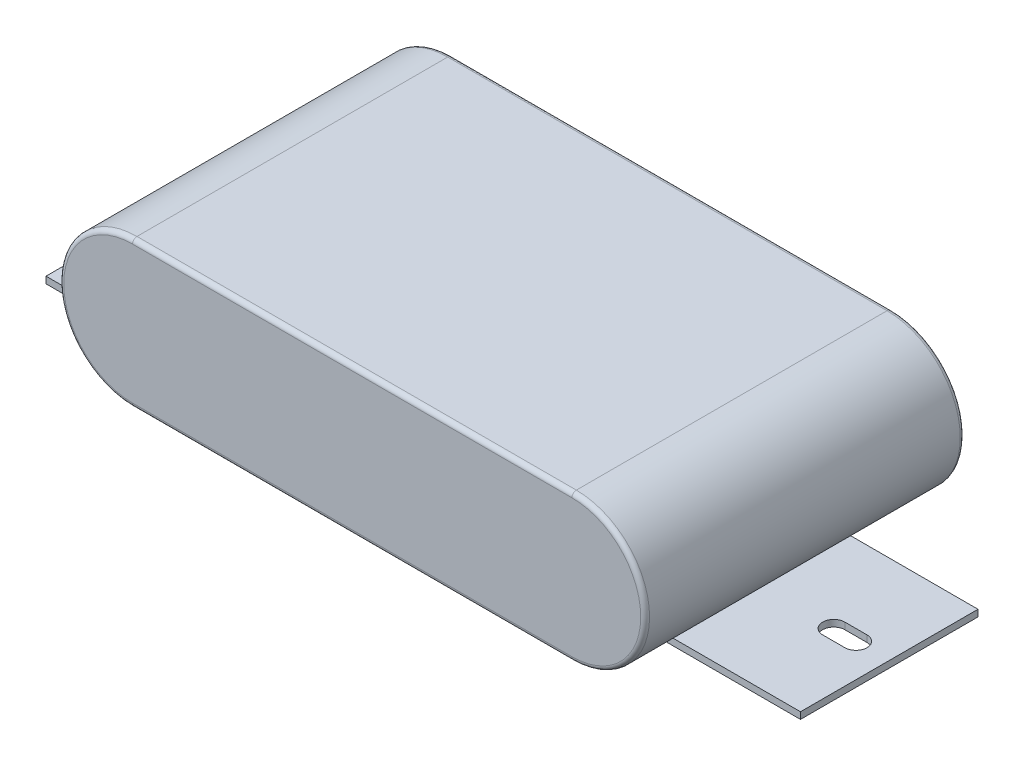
ISO-10303-21;
HEADER;
FILE_DESCRIPTION(('STEP AP214'),'2;1');
FILE_NAME('part.step','',(''),(''),'','','');
FILE_SCHEMA(('AUTOMOTIVE_DESIGN { 1 0 10303 214 1 1 1 1 }'));
ENDSEC;
DATA;
#1=APPLICATION_CONTEXT('core data for automotive mechanical design processes');
#2=APPLICATION_PROTOCOL_DEFINITION('international standard','automotive_design',2000,#1);
#3=PRODUCT_CONTEXT('',#1,'mechanical');
#4=PRODUCT('Part','Part','',(#3));
#5=PRODUCT_RELATED_PRODUCT_CATEGORY('part','',(#4));
#6=PRODUCT_DEFINITION_FORMATION('','',#4);
#7=PRODUCT_DEFINITION_CONTEXT('part definition',#1,'design');
#8=PRODUCT_DEFINITION('design','',#6,#7);
#9=PRODUCT_DEFINITION_SHAPE('','',#8);
#10=(LENGTH_UNIT() NAMED_UNIT(*) SI_UNIT(.MILLI.,.METRE.));
#11=(NAMED_UNIT(*) PLANE_ANGLE_UNIT() SI_UNIT($,.RADIAN.));
#12=(NAMED_UNIT(*) SI_UNIT($,.STERADIAN.) SOLID_ANGLE_UNIT());
#13=UNCERTAINTY_MEASURE_WITH_UNIT(LENGTH_MEASURE(1.E-05),#10,'distance_accuracy_value','');
#14=(GEOMETRIC_REPRESENTATION_CONTEXT(3) GLOBAL_UNCERTAINTY_ASSIGNED_CONTEXT((#13)) GLOBAL_UNIT_ASSIGNED_CONTEXT((#10,
#11,#12)) REPRESENTATION_CONTEXT('',''));
#15=CARTESIAN_POINT('',(0.,0.,0.));
#16=DIRECTION('',(0.,0.,1.));
#17=DIRECTION('',(1.,0.,0.));
#18=AXIS2_PLACEMENT_3D('',#15,#16,#17);
#19=CARTESIAN_POINT('',(0.,0.,0.));
#20=DIRECTION('',(0.,-1.,0.));
#21=DIRECTION('',(0.,0.,-1.));
#22=AXIS2_PLACEMENT_3D('',#19,#20,#21);
#23=PLANE('',#22);
#24=DIRECTION('',(-1.,0.,0.));
#25=VECTOR('',#24,1.);
#26=CARTESIAN_POINT('',(-85.,0.,-20.));
#27=LINE('',#26,#25);
#28=CARTESIAN_POINT('',(-49.5,0.,-20.));
#29=VERTEX_POINT('',#28);
#30=CARTESIAN_POINT('',(-85.,0.,-20.));
#31=VERTEX_POINT('',#30);
#32=EDGE_CURVE('E437',#29,#31,#27,.T.);
#33=ORIENTED_EDGE('',*,*,#32,.F.);
#34=DIRECTION('',(0.,0.,1.));
#35=VECTOR('',#34,1.);
#36=CARTESIAN_POINT('',(-49.5,0.,0.));
#37=LINE('',#36,#35);
#38=CARTESIAN_POINT('',(-49.5,0.,20.));
#39=VERTEX_POINT('',#38);
#40=EDGE_CURVE('E10',#29,#39,#37,.T.);
#41=ORIENTED_EDGE('',*,*,#40,.T.);
#42=DIRECTION('',(1.,0.,0.));
#43=VECTOR('',#42,1.);
#44=CARTESIAN_POINT('',(-85.,0.,20.));
#45=LINE('',#44,#43);
#46=CARTESIAN_POINT('',(-85.,0.,20.));
#47=VERTEX_POINT('',#46);
#48=EDGE_CURVE('E423',#47,#39,#45,.T.);
#49=ORIENTED_EDGE('',*,*,#48,.F.);
#50=DIRECTION('',(0.,0.,1.));
#51=VECTOR('',#50,1.);
#52=CARTESIAN_POINT('',(-85.,0.,20.));
#53=LINE('',#52,#51);
#54=CARTESIAN_POINT('',(-85.,0.,2.5));
#55=VERTEX_POINT('',#54);
#56=EDGE_CURVE('E441',#55,#47,#53,.T.);
#57=ORIENTED_EDGE('',*,*,#56,.F.);
#58=DIRECTION('',(1.,0.,0.));
#59=VECTOR('',#58,1.);
#60=CARTESIAN_POINT('',(-77.5,0.,2.5));
#61=LINE('',#60,#59);
#62=CARTESIAN_POINT('',(-77.5,0.,2.5));
#63=VERTEX_POINT('',#62);
#64=EDGE_CURVE('E394',#55,#63,#61,.T.);
#65=ORIENTED_EDGE('',*,*,#64,.T.);
#66=CARTESIAN_POINT('',(-77.5,0.,0.));
#67=DIRECTION('',(0.,1.,0.));
#68=DIRECTION('',(0.,0.,-1.));
#69=AXIS2_PLACEMENT_3D('',#66,#67,#68);
#70=CIRCLE('',#69,2.5);
#71=CARTESIAN_POINT('',(-77.5,0.,-2.5));
#72=VERTEX_POINT('',#71);
#73=EDGE_CURVE('E405',#63,#72,#70,.T.);
#74=ORIENTED_EDGE('',*,*,#73,.T.);
#75=DIRECTION('',(-1.,0.,0.));
#76=VECTOR('',#75,1.);
#77=CARTESIAN_POINT('',(-85.,0.,-2.5));
#78=LINE('',#77,#76);
#79=CARTESIAN_POINT('',(-85.,0.,-2.5));
#80=VERTEX_POINT('',#79);
#81=EDGE_CURVE('E398',#72,#80,#78,.T.);
#82=ORIENTED_EDGE('',*,*,#81,.T.);
#83=EDGE_CURVE('E442',#31,#80,#53,.T.);
#84=ORIENTED_EDGE('',*,*,#83,.F.);
#85=EDGE_LOOP('',(#33,#41,#49,#57,#65,#74,#82,#84));
#86=FACE_BOUND('',#85,.T.);
#87=ADVANCED_FACE('F16',(#86),#23,.T.);
#88=DIRECTION('',(-1.,0.,0.));
#89=VECTOR('',#88,1.);
#90=CARTESIAN_POINT('',(72.5,0.,-2.5));
#91=LINE('',#90,#89);
#92=CARTESIAN_POINT('',(77.5,0.,-2.5));
#93=VERTEX_POINT('',#92);
#94=CARTESIAN_POINT('',(72.5,0.,-2.5));
#95=VERTEX_POINT('',#94);
#96=EDGE_CURVE('E370',#93,#95,#91,.T.);
#97=ORIENTED_EDGE('',*,*,#96,.T.);
#98=CARTESIAN_POINT('',(72.5,0.,0.));
#99=DIRECTION('',(0.,1.,0.));
#100=DIRECTION('',(0.,0.,1.));
#101=AXIS2_PLACEMENT_3D('',#98,#99,#100);
#102=CIRCLE('',#101,2.5);
#103=CARTESIAN_POINT('',(72.5,0.,2.5));
#104=VERTEX_POINT('',#103);
#105=EDGE_CURVE('E355',#95,#104,#102,.T.);
#106=ORIENTED_EDGE('',*,*,#105,.T.);
#107=DIRECTION('',(1.,0.,0.));
#108=VECTOR('',#107,1.);
#109=CARTESIAN_POINT('',(72.5,0.,2.5));
#110=LINE('',#109,#108);
#111=CARTESIAN_POINT('',(77.5,0.,2.5));
#112=VERTEX_POINT('',#111);
#113=EDGE_CURVE('E358',#104,#112,#110,.T.);
#114=ORIENTED_EDGE('',*,*,#113,.T.);
#115=CARTESIAN_POINT('',(77.5,0.,0.));
#116=DIRECTION('',(0.,1.,0.));
#117=DIRECTION('',(0.,0.,1.));
#118=AXIS2_PLACEMENT_3D('',#115,#116,#117);
#119=CIRCLE('',#118,2.5);
#120=EDGE_CURVE('E380',#112,#93,#119,.T.);
#121=ORIENTED_EDGE('',*,*,#120,.T.);
#122=EDGE_LOOP('',(#97,#106,#114,#121));
#123=FACE_BOUND('',#122,.T.);
#124=CARTESIAN_POINT('',(49.5,0.,20.));
#125=VERTEX_POINT('',#124);
#126=CARTESIAN_POINT('',(85.,0.,20.));
#127=VERTEX_POINT('',#126);
#128=EDGE_CURVE('E445',#125,#127,#45,.T.);
#129=ORIENTED_EDGE('',*,*,#128,.F.);
#130=DIRECTION('',(0.,0.,-1.));
#131=VECTOR('',#130,1.);
#132=CARTESIAN_POINT('',(49.5,0.,0.));
#133=LINE('',#132,#131);
#134=CARTESIAN_POINT('',(49.5,0.,-20.));
#135=VERTEX_POINT('',#134);
#136=EDGE_CURVE('E24',#125,#135,#133,.T.);
#137=ORIENTED_EDGE('',*,*,#136,.T.);
#138=CARTESIAN_POINT('',(85.,0.,-20.));
#139=VERTEX_POINT('',#138);
#140=EDGE_CURVE('E438',#139,#135,#27,.T.);
#141=ORIENTED_EDGE('',*,*,#140,.F.);
#142=DIRECTION('',(0.,0.,-1.));
#143=VECTOR('',#142,1.);
#144=CARTESIAN_POINT('',(85.,0.,20.));
#145=LINE('',#144,#143);
#146=EDGE_CURVE('E418',#127,#139,#145,.T.);
#147=ORIENTED_EDGE('',*,*,#146,.F.);
#148=EDGE_LOOP('',(#129,#137,#141,#147));
#149=FACE_BOUND('',#148,.T.);
#150=ADVANCED_FACE('F282',(#123,#149),#23,.T.);
#151=CARTESIAN_POINT('',(-85.,1.5,-20.));
#152=DIRECTION('',(0.,0.,1.));
#153=DIRECTION('',(1.,0.,0.));
#154=AXIS2_PLACEMENT_3D('',#151,#152,#153);
#155=PLANE('',#154);
#156=DIRECTION('',(0.,-1.,0.));
#157=VECTOR('',#156,1.);
#158=CARTESIAN_POINT('',(49.5,0.,-20.));
#159=LINE('',#158,#157);
#160=CARTESIAN_POINT('',(49.5,1.5,-20.));
#161=VERTEX_POINT('',#160);
#162=EDGE_CURVE('E216',#161,#135,#159,.T.);
#163=ORIENTED_EDGE('',*,*,#162,.F.);
#164=DIRECTION('',(-1.,0.,0.));
#165=VECTOR('',#164,1.);
#166=CARTESIAN_POINT('',(-85.,1.5,-20.));
#167=LINE('',#166,#165);
#168=CARTESIAN_POINT('',(85.,1.5,-20.));
#169=VERTEX_POINT('',#168);
#170=EDGE_CURVE('E424',#169,#161,#167,.T.);
#171=ORIENTED_EDGE('',*,*,#170,.F.);
#172=DIRECTION('',(0.,-1.,0.));
#173=VECTOR('',#172,1.);
#174=CARTESIAN_POINT('',(85.,1.5,-20.));
#175=LINE('',#174,#173);
#176=EDGE_CURVE('E456',#169,#139,#175,.T.);
#177=ORIENTED_EDGE('',*,*,#176,.T.);
#178=ORIENTED_EDGE('',*,*,#140,.T.);
#179=EDGE_LOOP('',(#163,#171,#177,#178));
#180=FACE_BOUND('',#179,.T.);
#181=ADVANCED_FACE('F289',(#180),#155,.F.);
#182=CARTESIAN_POINT('',(-85.,1.5,20.));
#183=DIRECTION('',(0.,0.,-1.));
#184=DIRECTION('',(-1.,0.,0.));
#185=AXIS2_PLACEMENT_3D('',#182,#183,#184);
#186=PLANE('',#185);
#187=DIRECTION('',(0.,1.,0.));
#188=VECTOR('',#187,1.);
#189=CARTESIAN_POINT('',(49.5,0.,20.));
#190=LINE('',#189,#188);
#191=CARTESIAN_POINT('',(49.5,1.5,20.));
#192=VERTEX_POINT('',#191);
#193=EDGE_CURVE('E495',#125,#192,#190,.T.);
#194=ORIENTED_EDGE('',*,*,#193,.F.);
#195=ORIENTED_EDGE('',*,*,#128,.T.);
#196=DIRECTION('',(0.,-1.,0.));
#197=VECTOR('',#196,1.);
#198=CARTESIAN_POINT('',(85.,1.5,20.));
#199=LINE('',#198,#197);
#200=CARTESIAN_POINT('',(85.,1.5,20.));
#201=VERTEX_POINT('',#200);
#202=EDGE_CURVE('E434',#201,#127,#199,.T.);
#203=ORIENTED_EDGE('',*,*,#202,.F.);
#204=DIRECTION('',(1.,0.,0.));
#205=VECTOR('',#204,1.);
#206=CARTESIAN_POINT('',(-85.,1.5,20.));
#207=LINE('',#206,#205);
#208=EDGE_CURVE('E430',#192,#201,#207,.T.);
#209=ORIENTED_EDGE('',*,*,#208,.F.);
#210=EDGE_LOOP('',(#194,#195,#203,#209));
#211=FACE_BOUND('',#210,.T.);
#212=ADVANCED_FACE('F309',(#211),#186,.F.);
#213=CARTESIAN_POINT('',(0.,1.5,0.));
#214=DIRECTION('',(0.,-1.,0.));
#215=DIRECTION('',(0.,0.,-1.));
#216=AXIS2_PLACEMENT_3D('',#213,#214,#215);
#217=PLANE('',#216);
#218=DIRECTION('',(0.,0.,1.));
#219=VECTOR('',#218,1.);
#220=CARTESIAN_POINT('',(-49.5,1.5,-36.));
#221=LINE('',#220,#219);
#222=CARTESIAN_POINT('',(-49.5,1.5,-20.));
#223=VERTEX_POINT('',#222);
#224=CARTESIAN_POINT('',(-49.5,1.5,20.));
#225=VERTEX_POINT('',#224);
#226=EDGE_CURVE('E366',#223,#225,#221,.T.);
#227=ORIENTED_EDGE('',*,*,#226,.F.);
#228=CARTESIAN_POINT('',(-85.,1.5,-20.));
#229=VERTEX_POINT('',#228);
#230=EDGE_CURVE('E422',#223,#229,#167,.T.);
#231=ORIENTED_EDGE('',*,*,#230,.T.);
#232=DIRECTION('',(0.,0.,1.));
#233=VECTOR('',#232,1.);
#234=CARTESIAN_POINT('',(-85.,1.5,20.));
#235=LINE('',#234,#233);
#236=CARTESIAN_POINT('',(-85.,1.5,-2.5));
#237=VERTEX_POINT('',#236);
#238=EDGE_CURVE('E427',#229,#237,#235,.T.);
#239=ORIENTED_EDGE('',*,*,#238,.T.);
#240=DIRECTION('',(-1.,0.,0.));
#241=VECTOR('',#240,1.);
#242=CARTESIAN_POINT('',(-85.,1.5,-2.5));
#243=LINE('',#242,#241);
#244=CARTESIAN_POINT('',(-77.5,1.5,-2.5));
#245=VERTEX_POINT('',#244);
#246=EDGE_CURVE('E400',#245,#237,#243,.T.);
#247=ORIENTED_EDGE('',*,*,#246,.F.);
#248=CARTESIAN_POINT('',(-77.5,1.5,0.));
#249=DIRECTION('',(0.,1.,0.));
#250=DIRECTION('',(0.,0.,-1.));
#251=AXIS2_PLACEMENT_3D('',#248,#249,#250);
#252=CIRCLE('',#251,2.5);
#253=CARTESIAN_POINT('',(-77.5,1.5,2.5));
#254=VERTEX_POINT('',#253);
#255=EDGE_CURVE('E397',#254,#245,#252,.T.);
#256=ORIENTED_EDGE('',*,*,#255,.F.);
#257=DIRECTION('',(1.,0.,0.));
#258=VECTOR('',#257,1.);
#259=CARTESIAN_POINT('',(-77.5,1.5,2.5));
#260=LINE('',#259,#258);
#261=CARTESIAN_POINT('',(-85.,1.5,2.5));
#262=VERTEX_POINT('',#261);
#263=EDGE_CURVE('E395',#262,#254,#260,.T.);
#264=ORIENTED_EDGE('',*,*,#263,.F.);
#265=CARTESIAN_POINT('',(-85.,1.5,20.));
#266=VERTEX_POINT('',#265);
#267=EDGE_CURVE('E426',#262,#266,#235,.T.);
#268=ORIENTED_EDGE('',*,*,#267,.T.);
#269=EDGE_CURVE('E431',#266,#225,#207,.T.);
#270=ORIENTED_EDGE('',*,*,#269,.T.);
#271=EDGE_LOOP('',(#227,#231,#239,#247,#256,#264,#268,#270));
#272=FACE_BOUND('',#271,.T.);
#273=ADVANCED_FACE('F304',(#272),#217,.F.);
#274=ORIENTED_EDGE('',*,*,#170,.T.);
#275=DIRECTION('',(0.,0.,1.));
#276=VECTOR('',#275,1.);
#277=CARTESIAN_POINT('',(49.5,1.5,-36.));
#278=LINE('',#277,#276);
#279=EDGE_CURVE('E182',#161,#192,#278,.T.);
#280=ORIENTED_EDGE('',*,*,#279,.T.);
#281=ORIENTED_EDGE('',*,*,#208,.T.);
#282=DIRECTION('',(0.,0.,-1.));
#283=VECTOR('',#282,1.);
#284=CARTESIAN_POINT('',(85.,1.5,20.));
#285=LINE('',#284,#283);
#286=EDGE_CURVE('E419',#201,#169,#285,.T.);
#287=ORIENTED_EDGE('',*,*,#286,.T.);
#288=EDGE_LOOP('',(#274,#280,#281,#287));
#289=FACE_BOUND('',#288,.T.);
#290=CARTESIAN_POINT('',(72.5,1.5,0.));
#291=DIRECTION('',(0.,1.,0.));
#292=DIRECTION('',(0.,0.,1.));
#293=AXIS2_PLACEMENT_3D('',#290,#291,#292);
#294=CIRCLE('',#293,2.5);
#295=CARTESIAN_POINT('',(72.5,1.5,-2.5));
#296=VERTEX_POINT('',#295);
#297=CARTESIAN_POINT('',(72.5,1.5,2.5));
#298=VERTEX_POINT('',#297);
#299=EDGE_CURVE('E367',#296,#298,#294,.T.);
#300=ORIENTED_EDGE('',*,*,#299,.F.);
#301=DIRECTION('',(-1.,0.,0.));
#302=VECTOR('',#301,1.);
#303=CARTESIAN_POINT('',(72.5,1.5,-2.5));
#304=LINE('',#303,#302);
#305=CARTESIAN_POINT('',(77.5,1.5,-2.5));
#306=VERTEX_POINT('',#305);
#307=EDGE_CURVE('E375',#306,#296,#304,.T.);
#308=ORIENTED_EDGE('',*,*,#307,.F.);
#309=CARTESIAN_POINT('',(77.5,1.5,0.));
#310=DIRECTION('',(0.,1.,0.));
#311=DIRECTION('',(0.,0.,1.));
#312=AXIS2_PLACEMENT_3D('',#309,#310,#311);
#313=CIRCLE('',#312,2.5);
#314=CARTESIAN_POINT('',(77.5,1.5,2.5));
#315=VERTEX_POINT('',#314);
#316=EDGE_CURVE('E372',#315,#306,#313,.T.);
#317=ORIENTED_EDGE('',*,*,#316,.F.);
#318=DIRECTION('',(1.,0.,0.));
#319=VECTOR('',#318,1.);
#320=CARTESIAN_POINT('',(72.5,1.5,2.5));
#321=LINE('',#320,#319);
#322=EDGE_CURVE('E369',#298,#315,#321,.T.);
#323=ORIENTED_EDGE('',*,*,#322,.F.);
#324=EDGE_LOOP('',(#300,#308,#317,#323));
#325=FACE_BOUND('',#324,.T.);
#326=ADVANCED_FACE('F296',(#289,#325),#217,.F.);
#327=ORIENTED_EDGE('',*,*,#40,.F.);
#328=DIRECTION('',(-1.,0.,0.));
#329=VECTOR('',#328,1.);
#330=CARTESIAN_POINT('',(49.5,0.,-20.));
#331=LINE('',#330,#329);
#332=EDGE_CURVE('E219',#135,#29,#331,.T.);
#333=ORIENTED_EDGE('',*,*,#332,.F.);
#334=ORIENTED_EDGE('',*,*,#136,.F.);
#335=DIRECTION('',(-1.,0.,0.));
#336=VECTOR('',#335,1.);
#337=CARTESIAN_POINT('',(49.5,0.,20.));
#338=LINE('',#337,#336);
#339=EDGE_CURVE('E211',#125,#39,#338,.T.);
#340=ORIENTED_EDGE('',*,*,#339,.T.);
#341=EDGE_LOOP('',(#327,#333,#334,#340));
#342=FACE_BOUND('',#341,.T.);
#343=ADVANCED_FACE('F285',(#342),#23,.T.);
#344=CARTESIAN_POINT('',(-85.,1.5,20.));
#345=DIRECTION('',(1.,0.,0.));
#346=DIRECTION('',(0.,0.,-1.));
#347=AXIS2_PLACEMENT_3D('',#344,#345,#346);
#348=PLANE('',#347);
#349=DIRECTION('',(0.,-1.,0.));
#350=VECTOR('',#349,1.);
#351=CARTESIAN_POINT('',(-85.,1.5,2.5));
#352=LINE('',#351,#350);
#353=EDGE_CURVE('E415',#262,#55,#352,.T.);
#354=ORIENTED_EDGE('',*,*,#353,.T.);
#355=ORIENTED_EDGE('',*,*,#56,.T.);
#356=DIRECTION('',(0.,-1.,0.));
#357=VECTOR('',#356,1.);
#358=CARTESIAN_POINT('',(-85.,1.5,20.));
#359=LINE('',#358,#357);
#360=EDGE_CURVE('E450',#266,#47,#359,.T.);
#361=ORIENTED_EDGE('',*,*,#360,.F.);
#362=ORIENTED_EDGE('',*,*,#267,.F.);
#363=EDGE_LOOP('',(#354,#355,#361,#362));
#364=FACE_BOUND('',#363,.T.);
#365=ADVANCED_FACE('F295',(#364),#348,.F.);
#366=DIRECTION('',(0.,-1.,0.));
#367=VECTOR('',#366,1.);
#368=CARTESIAN_POINT('',(-85.,1.5,-2.5));
#369=LINE('',#368,#367);
#370=EDGE_CURVE('E402',#237,#80,#369,.T.);
#371=ORIENTED_EDGE('',*,*,#370,.F.);
#372=ORIENTED_EDGE('',*,*,#238,.F.);
#373=DIRECTION('',(0.,-1.,0.));
#374=VECTOR('',#373,1.);
#375=CARTESIAN_POINT('',(-85.,1.5,-20.));
#376=LINE('',#375,#374);
#377=EDGE_CURVE('E453',#229,#31,#376,.T.);
#378=ORIENTED_EDGE('',*,*,#377,.T.);
#379=ORIENTED_EDGE('',*,*,#83,.T.);
#380=EDGE_LOOP('',(#371,#372,#378,#379));
#381=FACE_BOUND('',#380,.T.);
#382=ADVANCED_FACE('F301',(#381),#348,.F.);
#383=CARTESIAN_POINT('',(85.,1.5,20.));
#384=DIRECTION('',(-1.,0.,0.));
#385=DIRECTION('',(0.,0.,1.));
#386=AXIS2_PLACEMENT_3D('',#383,#384,#385);
#387=PLANE('',#386);
#388=ORIENTED_EDGE('',*,*,#146,.T.);
#389=ORIENTED_EDGE('',*,*,#176,.F.);
#390=ORIENTED_EDGE('',*,*,#286,.F.);
#391=ORIENTED_EDGE('',*,*,#202,.T.);
#392=EDGE_LOOP('',(#388,#389,#390,#391));
#393=FACE_BOUND('',#392,.T.);
#394=ADVANCED_FACE('F681',(#393),#387,.F.);
#395=ORIENTED_EDGE('',*,*,#230,.F.);
#396=DIRECTION('',(0.,-1.,0.));
#397=VECTOR('',#396,1.);
#398=CARTESIAN_POINT('',(-49.5,0.,-20.));
#399=LINE('',#398,#397);
#400=EDGE_CURVE('E511',#223,#29,#399,.T.);
#401=ORIENTED_EDGE('',*,*,#400,.T.);
#402=ORIENTED_EDGE('',*,*,#32,.T.);
#403=ORIENTED_EDGE('',*,*,#377,.F.);
#404=EDGE_LOOP('',(#395,#401,#402,#403));
#405=FACE_BOUND('',#404,.T.);
#406=ADVANCED_FACE('F515',(#405),#155,.F.);
#407=ORIENTED_EDGE('',*,*,#48,.T.);
#408=DIRECTION('',(0.,1.,0.));
#409=VECTOR('',#408,1.);
#410=CARTESIAN_POINT('',(-49.5,0.,20.));
#411=LINE('',#410,#409);
#412=EDGE_CURVE('E501',#39,#225,#411,.T.);
#413=ORIENTED_EDGE('',*,*,#412,.T.);
#414=ORIENTED_EDGE('',*,*,#269,.F.);
#415=ORIENTED_EDGE('',*,*,#360,.T.);
#416=EDGE_LOOP('',(#407,#413,#414,#415));
#417=FACE_BOUND('',#416,.T.);
#418=ADVANCED_FACE('F318',(#417),#186,.F.);
#419=CARTESIAN_POINT('',(-77.5,1.5,2.5));
#420=DIRECTION('',(0.,0.,-1.));
#421=DIRECTION('',(-1.,0.,0.));
#422=AXIS2_PLACEMENT_3D('',#419,#420,#421);
#423=PLANE('',#422);
#424=ORIENTED_EDGE('',*,*,#64,.F.);
#425=ORIENTED_EDGE('',*,*,#353,.F.);
#426=ORIENTED_EDGE('',*,*,#263,.T.);
#427=DIRECTION('',(0.,-1.,0.));
#428=VECTOR('',#427,1.);
#429=CARTESIAN_POINT('',(-77.5,1.5,2.5));
#430=LINE('',#429,#428);
#431=EDGE_CURVE('E413',#254,#63,#430,.T.);
#432=ORIENTED_EDGE('',*,*,#431,.T.);
#433=EDGE_LOOP('',(#424,#425,#426,#432));
#434=FACE_BOUND('',#433,.T.);
#435=ADVANCED_FACE('F314',(#434),#423,.T.);
#436=CARTESIAN_POINT('',(-77.5,1.5,0.));
#437=DIRECTION('',(0.,-1.,0.));
#438=DIRECTION('',(0.,0.,-1.));
#439=AXIS2_PLACEMENT_3D('',#436,#437,#438);
#440=CYLINDRICAL_SURFACE('',#439,2.5);
#441=ORIENTED_EDGE('',*,*,#73,.F.);
#442=ORIENTED_EDGE('',*,*,#431,.F.);
#443=ORIENTED_EDGE('',*,*,#255,.T.);
#444=DIRECTION('',(0.,-1.,0.));
#445=VECTOR('',#444,1.);
#446=CARTESIAN_POINT('',(-77.5,1.5,-2.5));
#447=LINE('',#446,#445);
#448=EDGE_CURVE('E411',#245,#72,#447,.T.);
#449=ORIENTED_EDGE('',*,*,#448,.T.);
#450=EDGE_LOOP('',(#441,#442,#443,#449));
#451=FACE_BOUND('',#450,.T.);
#452=ADVANCED_FACE('F317',(#451),#440,.F.);
#453=CARTESIAN_POINT('',(-85.,1.5,-2.5));
#454=DIRECTION('',(0.,0.,1.));
#455=DIRECTION('',(1.,0.,0.));
#456=AXIS2_PLACEMENT_3D('',#453,#454,#455);
#457=PLANE('',#456);
#458=ORIENTED_EDGE('',*,*,#81,.F.);
#459=ORIENTED_EDGE('',*,*,#448,.F.);
#460=ORIENTED_EDGE('',*,*,#246,.T.);
#461=ORIENTED_EDGE('',*,*,#370,.T.);
#462=EDGE_LOOP('',(#458,#459,#460,#461));
#463=FACE_BOUND('',#462,.T.);
#464=ADVANCED_FACE('F322',(#463),#457,.T.);
#465=CARTESIAN_POINT('',(72.5,1.5,0.));
#466=DIRECTION('',(0.,-1.,0.));
#467=DIRECTION('',(0.,0.,-1.));
#468=AXIS2_PLACEMENT_3D('',#465,#466,#467);
#469=CYLINDRICAL_SURFACE('',#468,2.5);
#470=ORIENTED_EDGE('',*,*,#105,.F.);
#471=DIRECTION('',(0.,-1.,0.));
#472=VECTOR('',#471,1.);
#473=CARTESIAN_POINT('',(72.5,1.5,-2.5));
#474=LINE('',#473,#472);
#475=EDGE_CURVE('E376',#296,#95,#474,.T.);
#476=ORIENTED_EDGE('',*,*,#475,.F.);
#477=ORIENTED_EDGE('',*,*,#299,.T.);
#478=DIRECTION('',(0.,-1.,0.));
#479=VECTOR('',#478,1.);
#480=CARTESIAN_POINT('',(72.5,1.5,2.5));
#481=LINE('',#480,#479);
#482=EDGE_CURVE('E391',#298,#104,#481,.T.);
#483=ORIENTED_EDGE('',*,*,#482,.T.);
#484=EDGE_LOOP('',(#470,#476,#477,#483));
#485=FACE_BOUND('',#484,.T.);
#486=ADVANCED_FACE('F326',(#485),#469,.F.);
#487=CARTESIAN_POINT('',(72.5,1.5,2.5));
#488=DIRECTION('',(0.,0.,-1.));
#489=DIRECTION('',(-1.,0.,0.));
#490=AXIS2_PLACEMENT_3D('',#487,#488,#489);
#491=PLANE('',#490);
#492=ORIENTED_EDGE('',*,*,#113,.F.);
#493=ORIENTED_EDGE('',*,*,#482,.F.);
#494=ORIENTED_EDGE('',*,*,#322,.T.);
#495=DIRECTION('',(0.,-1.,0.));
#496=VECTOR('',#495,1.);
#497=CARTESIAN_POINT('',(77.5,1.5,2.5));
#498=LINE('',#497,#496);
#499=EDGE_CURVE('E389',#315,#112,#498,.T.);
#500=ORIENTED_EDGE('',*,*,#499,.T.);
#501=EDGE_LOOP('',(#492,#493,#494,#500));
#502=FACE_BOUND('',#501,.T.);
#503=ADVANCED_FACE('F330',(#502),#491,.T.);
#504=CARTESIAN_POINT('',(77.5,1.5,0.));
#505=DIRECTION('',(0.,-1.,0.));
#506=DIRECTION('',(0.,0.,-1.));
#507=AXIS2_PLACEMENT_3D('',#504,#505,#506);
#508=CYLINDRICAL_SURFACE('',#507,2.5);
#509=ORIENTED_EDGE('',*,*,#120,.F.);
#510=ORIENTED_EDGE('',*,*,#499,.F.);
#511=ORIENTED_EDGE('',*,*,#316,.T.);
#512=DIRECTION('',(0.,-1.,0.));
#513=VECTOR('',#512,1.);
#514=CARTESIAN_POINT('',(77.5,1.5,-2.5));
#515=LINE('',#514,#513);
#516=EDGE_CURVE('E387',#306,#93,#515,.T.);
#517=ORIENTED_EDGE('',*,*,#516,.T.);
#518=EDGE_LOOP('',(#509,#510,#511,#517));
#519=FACE_BOUND('',#518,.T.);
#520=ADVANCED_FACE('F334',(#519),#508,.F.);
#521=CARTESIAN_POINT('',(72.5,1.5,-2.5));
#522=DIRECTION('',(0.,0.,1.));
#523=DIRECTION('',(1.,0.,0.));
#524=AXIS2_PLACEMENT_3D('',#521,#522,#523);
#525=PLANE('',#524);
#526=ORIENTED_EDGE('',*,*,#96,.F.);
#527=ORIENTED_EDGE('',*,*,#516,.F.);
#528=ORIENTED_EDGE('',*,*,#307,.T.);
#529=ORIENTED_EDGE('',*,*,#475,.T.);
#530=EDGE_LOOP('',(#526,#527,#528,#529));
#531=FACE_BOUND('',#530,.T.);
#532=ADVANCED_FACE('F338',(#531),#525,.T.);
#533=CARTESIAN_POINT('',(-49.5,34.5,-36.));
#534=DIRECTION('',(0.,1.,0.));
#535=DIRECTION('',(0.,0.,1.));
#536=AXIS2_PLACEMENT_3D('',#533,#534,#535);
#537=PLANE('',#536);
#538=DIRECTION('',(0.,0.,1.));
#539=VECTOR('',#538,1.);
#540=CARTESIAN_POINT('',(-49.5,34.5,-36.));
#541=LINE('',#540,#539);
#542=CARTESIAN_POINT('',(-49.5,34.5,-35.));
#543=VERTEX_POINT('',#542);
#544=CARTESIAN_POINT('',(-49.5,34.5,35.));
#545=VERTEX_POINT('',#544);
#546=EDGE_CURVE('E352',#543,#545,#541,.T.);
#547=ORIENTED_EDGE('',*,*,#546,.T.);
#548=DIRECTION('',(-1.,0.,0.));
#549=VECTOR('',#548,1.);
#550=CARTESIAN_POINT('',(-49.5,34.5,35.));
#551=LINE('',#550,#549);
#552=CARTESIAN_POINT('',(49.5,34.5,35.));
#553=VERTEX_POINT('',#552);
#554=EDGE_CURVE('E199',#545,#553,#551,.F.);
#555=ORIENTED_EDGE('',*,*,#554,.T.);
#556=DIRECTION('',(0.,0.,1.));
#557=VECTOR('',#556,1.);
#558=CARTESIAN_POINT('',(49.5,34.5,-36.));
#559=LINE('',#558,#557);
#560=CARTESIAN_POINT('',(49.5,34.5,-35.));
#561=VERTEX_POINT('',#560);
#562=EDGE_CURVE('E186',#561,#553,#559,.T.);
#563=ORIENTED_EDGE('',*,*,#562,.F.);
#564=DIRECTION('',(-1.,0.,0.));
#565=VECTOR('',#564,1.);
#566=CARTESIAN_POINT('',(-49.5,34.5,-35.));
#567=LINE('',#566,#565);
#568=EDGE_CURVE('E263',#561,#543,#567,.T.);
#569=ORIENTED_EDGE('',*,*,#568,.T.);
#570=EDGE_LOOP('',(#547,#555,#563,#569));
#571=FACE_BOUND('',#570,.T.);
#572=ADVANCED_FACE('F341',(#571),#537,.T.);
#573=CARTESIAN_POINT('',(49.5,18.,-36.));
#574=DIRECTION('',(0.,0.,1.));
#575=DIRECTION('',(1.,0.,0.));
#576=AXIS2_PLACEMENT_3D('',#573,#574,#575);
#577=CYLINDRICAL_SURFACE('',#576,16.5);
#578=ORIENTED_EDGE('',*,*,#562,.T.);
#579=CARTESIAN_POINT('',(49.5,18.,35.));
#580=DIRECTION('',(0.,0.,1.));
#581=DIRECTION('',(1.,0.,0.));
#582=AXIS2_PLACEMENT_3D('',#579,#580,#581);
#583=CIRCLE('',#582,16.5);
#584=CARTESIAN_POINT('',(49.5,1.5,35.));
#585=VERTEX_POINT('',#584);
#586=EDGE_CURVE('E198',#553,#585,#583,.F.);
#587=ORIENTED_EDGE('',*,*,#586,.T.);
#588=EDGE_CURVE('E188',#192,#585,#278,.T.);
#589=ORIENTED_EDGE('',*,*,#588,.F.);
#590=ORIENTED_EDGE('',*,*,#279,.F.);
#591=CARTESIAN_POINT('',(49.5,1.5,-35.));
#592=VERTEX_POINT('',#591);
#593=EDGE_CURVE('E174',#592,#161,#278,.T.);
#594=ORIENTED_EDGE('',*,*,#593,.F.);
#595=CARTESIAN_POINT('',(49.5,18.,-35.));
#596=DIRECTION('',(0.,0.,1.));
#597=DIRECTION('',(1.,0.,0.));
#598=AXIS2_PLACEMENT_3D('',#595,#596,#597);
#599=CIRCLE('',#598,16.5);
#600=EDGE_CURVE('E178',#592,#561,#599,.T.);
#601=ORIENTED_EDGE('',*,*,#600,.T.);
#602=EDGE_LOOP('',(#578,#587,#589,#590,#594,#601));
#603=FACE_BOUND('',#602,.T.);
#604=ADVANCED_FACE('F177',(#603),#577,.T.);
#605=CARTESIAN_POINT('',(-49.5,18.,-36.));
#606=DIRECTION('',(0.,0.,1.));
#607=DIRECTION('',(1.,0.,0.));
#608=AXIS2_PLACEMENT_3D('',#605,#606,#607);
#609=CYLINDRICAL_SURFACE('',#608,16.5);
#610=CARTESIAN_POINT('',(-49.5,1.5,35.));
#611=VERTEX_POINT('',#610);
#612=EDGE_CURVE('E248',#225,#611,#221,.T.);
#613=ORIENTED_EDGE('',*,*,#612,.T.);
#614=CARTESIAN_POINT('',(-49.5,18.,35.));
#615=DIRECTION('',(0.,0.,1.));
#616=DIRECTION('',(1.,0.,0.));
#617=AXIS2_PLACEMENT_3D('',#614,#615,#616);
#618=CIRCLE('',#617,16.5);
#619=EDGE_CURVE('E469',#611,#545,#618,.F.);
#620=ORIENTED_EDGE('',*,*,#619,.T.);
#621=ORIENTED_EDGE('',*,*,#546,.F.);
#622=CARTESIAN_POINT('',(-49.5,18.,-35.));
#623=DIRECTION('',(0.,0.,1.));
#624=DIRECTION('',(1.,0.,0.));
#625=AXIS2_PLACEMENT_3D('',#622,#623,#624);
#626=CIRCLE('',#625,16.5);
#627=CARTESIAN_POINT('',(-49.5,1.5,-35.));
#628=VERTEX_POINT('',#627);
#629=EDGE_CURVE('E259',#543,#628,#626,.T.);
#630=ORIENTED_EDGE('',*,*,#629,.T.);
#631=EDGE_CURVE('E364',#628,#223,#221,.T.);
#632=ORIENTED_EDGE('',*,*,#631,.T.);
#633=ORIENTED_EDGE('',*,*,#226,.T.);
#634=EDGE_LOOP('',(#613,#620,#621,#630,#632,#633));
#635=FACE_BOUND('',#634,.T.);
#636=ADVANCED_FACE('F268',(#635),#609,.T.);
#637=CARTESIAN_POINT('',(-49.5,18.,-36.));
#638=DIRECTION('',(0.,0.,1.));
#639=DIRECTION('',(1.,0.,0.));
#640=AXIS2_PLACEMENT_3D('',#637,#638,#639);
#641=PLANE('',#640);
#642=CARTESIAN_POINT('',(49.5,18.,-36.));
#643=DIRECTION('',(0.,0.,1.));
#644=DIRECTION('',(1.,0.,0.));
#645=AXIS2_PLACEMENT_3D('',#642,#643,#644);
#646=CIRCLE('',#645,15.5);
#647=CARTESIAN_POINT('',(49.5,33.5,-36.));
#648=VERTEX_POINT('',#647);
#649=CARTESIAN_POINT('',(49.5,2.5,-36.));
#650=VERTEX_POINT('',#649);
#651=EDGE_CURVE('E225',#648,#650,#646,.F.);
#652=ORIENTED_EDGE('',*,*,#651,.T.);
#653=DIRECTION('',(1.,0.,0.));
#654=VECTOR('',#653,1.);
#655=CARTESIAN_POINT('',(-49.5,2.5,-36.));
#656=LINE('',#655,#654);
#657=CARTESIAN_POINT('',(-49.5,2.5,-36.));
#658=VERTEX_POINT('',#657);
#659=EDGE_CURVE('E209',#650,#658,#656,.F.);
#660=ORIENTED_EDGE('',*,*,#659,.T.);
#661=CARTESIAN_POINT('',(-49.5,18.,-36.));
#662=DIRECTION('',(0.,0.,1.));
#663=DIRECTION('',(1.,0.,0.));
#664=AXIS2_PLACEMENT_3D('',#661,#662,#663);
#665=CIRCLE('',#664,15.5);
#666=CARTESIAN_POINT('',(-49.5,33.5,-36.));
#667=VERTEX_POINT('',#666);
#668=EDGE_CURVE('E232',#658,#667,#665,.F.);
#669=ORIENTED_EDGE('',*,*,#668,.T.);
#670=DIRECTION('',(-1.,0.,0.));
#671=VECTOR('',#670,1.);
#672=CARTESIAN_POINT('',(49.5,33.5,-36.));
#673=LINE('',#672,#671);
#674=EDGE_CURVE('E227',#667,#648,#673,.F.);
#675=ORIENTED_EDGE('',*,*,#674,.T.);
#676=EDGE_LOOP('',(#652,#660,#669,#675));
#677=FACE_BOUND('',#676,.T.);
#678=ADVANCED_FACE('F265',(#677),#641,.F.);
#679=CARTESIAN_POINT('',(-49.5,18.,36.));
#680=DIRECTION('',(0.,0.,1.));
#681=DIRECTION('',(1.,0.,0.));
#682=AXIS2_PLACEMENT_3D('',#679,#680,#681);
#683=PLANE('',#682);
#684=DIRECTION('',(-1.,0.,0.));
#685=VECTOR('',#684,1.);
#686=CARTESIAN_POINT('',(-49.5,33.5,36.));
#687=LINE('',#686,#685);
#688=CARTESIAN_POINT('',(49.5,33.5,36.));
#689=VERTEX_POINT('',#688);
#690=CARTESIAN_POINT('',(-49.5,33.5,36.));
#691=VERTEX_POINT('',#690);
#692=EDGE_CURVE('E463',#689,#691,#687,.T.);
#693=ORIENTED_EDGE('',*,*,#692,.T.);
#694=CARTESIAN_POINT('',(-49.5,18.,36.));
#695=DIRECTION('',(0.,0.,1.));
#696=DIRECTION('',(1.,0.,0.));
#697=AXIS2_PLACEMENT_3D('',#694,#695,#696);
#698=CIRCLE('',#697,15.5);
#699=CARTESIAN_POINT('',(-49.5,2.5,36.));
#700=VERTEX_POINT('',#699);
#701=EDGE_CURVE('E465',#691,#700,#698,.T.);
#702=ORIENTED_EDGE('',*,*,#701,.T.);
#703=DIRECTION('',(1.,0.,0.));
#704=VECTOR('',#703,1.);
#705=CARTESIAN_POINT('',(-49.5,2.5,36.));
#706=LINE('',#705,#704);
#707=CARTESIAN_POINT('',(49.5,2.5,36.));
#708=VERTEX_POINT('',#707);
#709=EDGE_CURVE('E459',#700,#708,#706,.T.);
#710=ORIENTED_EDGE('',*,*,#709,.T.);
#711=CARTESIAN_POINT('',(49.5,18.,36.));
#712=DIRECTION('',(0.,0.,1.));
#713=DIRECTION('',(1.,0.,0.));
#714=AXIS2_PLACEMENT_3D('',#711,#712,#713);
#715=CIRCLE('',#714,15.5);
#716=EDGE_CURVE('E461',#708,#689,#715,.T.);
#717=ORIENTED_EDGE('',*,*,#716,.T.);
#718=EDGE_LOOP('',(#693,#702,#710,#717));
#719=FACE_BOUND('',#718,.T.);
#720=ADVANCED_FACE('F267',(#719),#683,.T.);
#721=CARTESIAN_POINT('',(49.5,18.,35.));
#722=DIRECTION('',(0.,0.,1.));
#723=DIRECTION('',(1.,0.,0.));
#724=AXIS2_PLACEMENT_3D('',#721,#722,#723);
#725=TOROIDAL_SURFACE('',#724,15.5,1.);
#726=CARTESIAN_POINT('',(49.5,2.5,35.));
#727=DIRECTION('',(-1.,0.,0.));
#728=DIRECTION('',(0.,0.,1.));
#729=AXIS2_PLACEMENT_3D('',#726,#727,#728);
#730=CIRCLE('',#729,1.);
#731=EDGE_CURVE('E243',#585,#708,#730,.T.);
#732=ORIENTED_EDGE('',*,*,#731,.F.);
#733=ORIENTED_EDGE('',*,*,#586,.F.);
#734=CARTESIAN_POINT('',(49.5,33.5,35.));
#735=DIRECTION('',(-1.,0.,0.));
#736=DIRECTION('',(0.,0.,1.));
#737=AXIS2_PLACEMENT_3D('',#734,#735,#736);
#738=CIRCLE('',#737,1.);
#739=EDGE_CURVE('E246',#689,#553,#738,.T.);
#740=ORIENTED_EDGE('',*,*,#739,.F.);
#741=ORIENTED_EDGE('',*,*,#716,.F.);
#742=EDGE_LOOP('',(#732,#733,#740,#741));
#743=FACE_BOUND('',#742,.T.);
#744=ADVANCED_FACE('F275',(#743),#725,.T.);
#745=CARTESIAN_POINT('',(-49.5,33.5,35.));
#746=DIRECTION('',(-1.,0.,0.));
#747=DIRECTION('',(0.,0.,1.));
#748=AXIS2_PLACEMENT_3D('',#745,#746,#747);
#749=CYLINDRICAL_SURFACE('',#748,1.);
#750=ORIENTED_EDGE('',*,*,#739,.T.);
#751=ORIENTED_EDGE('',*,*,#554,.F.);
#752=CARTESIAN_POINT('',(-49.5,33.5,35.));
#753=DIRECTION('',(-1.,0.,0.));
#754=DIRECTION('',(0.,0.,1.));
#755=AXIS2_PLACEMENT_3D('',#752,#753,#754);
#756=CIRCLE('',#755,1.);
#757=EDGE_CURVE('E240',#691,#545,#756,.T.);
#758=ORIENTED_EDGE('',*,*,#757,.F.);
#759=ORIENTED_EDGE('',*,*,#692,.F.);
#760=EDGE_LOOP('',(#750,#751,#758,#759));
#761=FACE_BOUND('',#760,.T.);
#762=ADVANCED_FACE('F483',(#761),#749,.T.);
#763=CARTESIAN_POINT('',(-49.5,2.5,35.));
#764=DIRECTION('',(1.,0.,0.));
#765=DIRECTION('',(0.,1.,0.));
#766=AXIS2_PLACEMENT_3D('',#763,#764,#765);
#767=CYLINDRICAL_SURFACE('',#766,1.);
#768=ORIENTED_EDGE('',*,*,#731,.T.);
#769=ORIENTED_EDGE('',*,*,#709,.F.);
#770=CARTESIAN_POINT('',(-49.5,2.5,35.));
#771=DIRECTION('',(-1.,0.,0.));
#772=DIRECTION('',(0.,0.,1.));
#773=AXIS2_PLACEMENT_3D('',#770,#771,#772);
#774=CIRCLE('',#773,1.);
#775=EDGE_CURVE('E238',#611,#700,#774,.T.);
#776=ORIENTED_EDGE('',*,*,#775,.F.);
#777=DIRECTION('',(1.,0.,0.));
#778=VECTOR('',#777,1.);
#779=CARTESIAN_POINT('',(49.5,1.49999999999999,35.));
#780=LINE('',#779,#778);
#781=EDGE_CURVE('E235',#585,#611,#780,.F.);
#782=ORIENTED_EDGE('',*,*,#781,.F.);
#783=EDGE_LOOP('',(#768,#769,#776,#782));
#784=FACE_BOUND('',#783,.T.);
#785=ADVANCED_FACE('F534',(#784),#767,.T.);
#786=CARTESIAN_POINT('',(-49.5,18.,35.));
#787=DIRECTION('',(0.,0.,1.));
#788=DIRECTION('',(1.,0.,0.));
#789=AXIS2_PLACEMENT_3D('',#786,#787,#788);
#790=TOROIDAL_SURFACE('',#789,15.5,1.);
#791=ORIENTED_EDGE('',*,*,#757,.T.);
#792=ORIENTED_EDGE('',*,*,#619,.F.);
#793=ORIENTED_EDGE('',*,*,#775,.T.);
#794=ORIENTED_EDGE('',*,*,#701,.F.);
#795=EDGE_LOOP('',(#791,#792,#793,#794));
#796=FACE_BOUND('',#795,.T.);
#797=ADVANCED_FACE('F477',(#796),#790,.T.);
#798=CARTESIAN_POINT('',(-49.5,33.5,-35.));
#799=DIRECTION('',(1.,0.,0.));
#800=DIRECTION('',(0.,0.,-1.));
#801=AXIS2_PLACEMENT_3D('',#798,#799,#800);
#802=CYLINDRICAL_SURFACE('',#801,1.);
#803=CARTESIAN_POINT('',(49.5,33.5,-35.));
#804=DIRECTION('',(1.,0.,0.));
#805=DIRECTION('',(0.,0.,-1.));
#806=AXIS2_PLACEMENT_3D('',#803,#804,#805);
#807=CIRCLE('',#806,1.);
#808=EDGE_CURVE('E197',#648,#561,#807,.T.);
#809=ORIENTED_EDGE('',*,*,#808,.F.);
#810=ORIENTED_EDGE('',*,*,#674,.F.);
#811=CARTESIAN_POINT('',(-49.5,33.5,-35.));
#812=DIRECTION('',(-1.,0.,0.));
#813=DIRECTION('',(0.,0.,1.));
#814=AXIS2_PLACEMENT_3D('',#811,#812,#813);
#815=CIRCLE('',#814,1.);
#816=EDGE_CURVE('E241',#543,#667,#815,.T.);
#817=ORIENTED_EDGE('',*,*,#816,.F.);
#818=ORIENTED_EDGE('',*,*,#568,.F.);
#819=EDGE_LOOP('',(#809,#810,#817,#818));
#820=FACE_BOUND('',#819,.T.);
#821=ADVANCED_FACE('F18',(#820),#802,.T.);
#822=CARTESIAN_POINT('',(-49.5,18.,-35.));
#823=DIRECTION('',(0.,0.,1.));
#824=DIRECTION('',(1.,0.,0.));
#825=AXIS2_PLACEMENT_3D('',#822,#823,#824);
#826=TOROIDAL_SURFACE('',#825,15.5,1.);
#827=ORIENTED_EDGE('',*,*,#816,.T.);
#828=ORIENTED_EDGE('',*,*,#668,.F.);
#829=CARTESIAN_POINT('',(-49.5,2.5,-35.));
#830=DIRECTION('',(1.,0.,0.));
#831=DIRECTION('',(0.,0.,-1.));
#832=AXIS2_PLACEMENT_3D('',#829,#830,#831);
#833=CIRCLE('',#832,1.);
#834=EDGE_CURVE('E210',#628,#658,#833,.T.);
#835=ORIENTED_EDGE('',*,*,#834,.F.);
#836=ORIENTED_EDGE('',*,*,#629,.F.);
#837=EDGE_LOOP('',(#827,#828,#835,#836));
#838=FACE_BOUND('',#837,.T.);
#839=ADVANCED_FACE('F257',(#838),#826,.T.);
#840=CARTESIAN_POINT('',(49.5,18.,-35.));
#841=DIRECTION('',(0.,0.,1.));
#842=DIRECTION('',(1.,0.,0.));
#843=AXIS2_PLACEMENT_3D('',#840,#841,#842);
#844=TOROIDAL_SURFACE('',#843,15.5,1.);
#845=ORIENTED_EDGE('',*,*,#808,.T.);
#846=ORIENTED_EDGE('',*,*,#600,.F.);
#847=CARTESIAN_POINT('',(49.5,2.5,-35.));
#848=DIRECTION('',(-1.,0.,0.));
#849=DIRECTION('',(0.,0.,1.));
#850=AXIS2_PLACEMENT_3D('',#847,#848,#849);
#851=CIRCLE('',#850,1.);
#852=EDGE_CURVE('E195',#650,#592,#851,.T.);
#853=ORIENTED_EDGE('',*,*,#852,.F.);
#854=ORIENTED_EDGE('',*,*,#651,.F.);
#855=EDGE_LOOP('',(#845,#846,#853,#854));
#856=FACE_BOUND('',#855,.T.);
#857=ADVANCED_FACE('F193',(#856),#844,.T.);
#858=CARTESIAN_POINT('',(49.5,2.49999999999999,-35.));
#859=DIRECTION('',(-1.,0.,0.));
#860=DIRECTION('',(0.,-1.,0.));
#861=AXIS2_PLACEMENT_3D('',#858,#859,#860);
#862=CYLINDRICAL_SURFACE('',#861,1.);
#863=ORIENTED_EDGE('',*,*,#834,.T.);
#864=ORIENTED_EDGE('',*,*,#659,.F.);
#865=ORIENTED_EDGE('',*,*,#852,.T.);
#866=DIRECTION('',(1.,0.,0.));
#867=VECTOR('',#866,1.);
#868=CARTESIAN_POINT('',(49.5,1.49999999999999,-35.));
#869=LINE('',#868,#867);
#870=EDGE_CURVE('E206',#628,#592,#869,.T.);
#871=ORIENTED_EDGE('',*,*,#870,.F.);
#872=EDGE_LOOP('',(#863,#864,#865,#871));
#873=FACE_BOUND('',#872,.T.);
#874=ADVANCED_FACE('F204',(#873),#862,.T.);
#875=CARTESIAN_POINT('',(49.5,1.5,35.));
#876=DIRECTION('',(0.,0.995037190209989,-0.099503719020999));
#877=DIRECTION('',(0.,0.099503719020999,0.995037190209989));
#878=AXIS2_PLACEMENT_3D('',#875,#876,#877);
#879=PLANE('',#878);
#880=ORIENTED_EDGE('',*,*,#781,.T.);
#881=DIRECTION('',(0.,-0.099503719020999,-0.995037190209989));
#882=VECTOR('',#881,1.);
#883=CARTESIAN_POINT('',(-49.5,1.5,35.));
#884=LINE('',#883,#882);
#885=EDGE_CURVE('E505',#611,#39,#884,.T.);
#886=ORIENTED_EDGE('',*,*,#885,.T.);
#887=ORIENTED_EDGE('',*,*,#339,.F.);
#888=DIRECTION('',(0.,-0.099503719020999,-0.995037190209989));
#889=VECTOR('',#888,1.);
#890=CARTESIAN_POINT('',(49.5,1.5,35.));
#891=LINE('',#890,#889);
#892=EDGE_CURVE('E498',#585,#125,#891,.T.);
#893=ORIENTED_EDGE('',*,*,#892,.F.);
#894=EDGE_LOOP('',(#880,#886,#887,#893));
#895=FACE_BOUND('',#894,.T.);
#896=ADVANCED_FACE('F532',(#895),#879,.F.);
#897=CARTESIAN_POINT('',(49.5,0.,0.));
#898=DIRECTION('',(-1.,0.,0.));
#899=DIRECTION('',(0.,0.,1.));
#900=AXIS2_PLACEMENT_3D('',#897,#898,#899);
#901=PLANE('',#900);
#902=ORIENTED_EDGE('',*,*,#588,.T.);
#903=ORIENTED_EDGE('',*,*,#892,.T.);
#904=ORIENTED_EDGE('',*,*,#193,.T.);
#905=EDGE_LOOP('',(#902,#903,#904));
#906=FACE_BOUND('',#905,.T.);
#907=ADVANCED_FACE('F496',(#906),#901,.F.);
#908=CARTESIAN_POINT('',(-49.5,0.,0.));
#909=DIRECTION('',(-1.,0.,0.));
#910=DIRECTION('',(0.,0.,1.));
#911=AXIS2_PLACEMENT_3D('',#908,#909,#910);
#912=PLANE('',#911);
#913=ORIENTED_EDGE('',*,*,#612,.F.);
#914=ORIENTED_EDGE('',*,*,#412,.F.);
#915=ORIENTED_EDGE('',*,*,#885,.F.);
#916=EDGE_LOOP('',(#913,#914,#915));
#917=FACE_BOUND('',#916,.T.);
#918=ADVANCED_FACE('F530',(#917),#912,.T.);
#919=CARTESIAN_POINT('',(49.5,1.5,-35.));
#920=DIRECTION('',(0.,0.995037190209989,0.0995037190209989));
#921=DIRECTION('',(0.,-0.099503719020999,0.995037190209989));
#922=AXIS2_PLACEMENT_3D('',#919,#920,#921);
#923=PLANE('',#922);
#924=ORIENTED_EDGE('',*,*,#332,.T.);
#925=DIRECTION('',(0.,0.099503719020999,-0.995037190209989));
#926=VECTOR('',#925,1.);
#927=CARTESIAN_POINT('',(-49.5,1.5,-35.));
#928=LINE('',#927,#926);
#929=EDGE_CURVE('E223',#29,#628,#928,.T.);
#930=ORIENTED_EDGE('',*,*,#929,.T.);
#931=ORIENTED_EDGE('',*,*,#870,.T.);
#932=DIRECTION('',(0.,0.099503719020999,-0.995037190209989));
#933=VECTOR('',#932,1.);
#934=CARTESIAN_POINT('',(49.5,1.5,-35.));
#935=LINE('',#934,#933);
#936=EDGE_CURVE('E214',#135,#592,#935,.T.);
#937=ORIENTED_EDGE('',*,*,#936,.F.);
#938=EDGE_LOOP('',(#924,#930,#931,#937));
#939=FACE_BOUND('',#938,.T.);
#940=ADVANCED_FACE('F221',(#939),#923,.F.);
#941=CARTESIAN_POINT('',(49.5,0.,0.));
#942=DIRECTION('',(-1.,0.,0.));
#943=DIRECTION('',(0.,0.,1.));
#944=AXIS2_PLACEMENT_3D('',#941,#942,#943);
#945=PLANE('',#944);
#946=ORIENTED_EDGE('',*,*,#162,.T.);
#947=ORIENTED_EDGE('',*,*,#936,.T.);
#948=ORIENTED_EDGE('',*,*,#593,.T.);
#949=EDGE_LOOP('',(#946,#947,#948));
#950=FACE_BOUND('',#949,.T.);
#951=ADVANCED_FACE('F215',(#950),#945,.F.);
#952=CARTESIAN_POINT('',(-49.5,0.,0.));
#953=DIRECTION('',(-1.,0.,0.));
#954=DIRECTION('',(0.,0.,1.));
#955=AXIS2_PLACEMENT_3D('',#952,#953,#954);
#956=PLANE('',#955);
#957=ORIENTED_EDGE('',*,*,#400,.F.);
#958=ORIENTED_EDGE('',*,*,#631,.F.);
#959=ORIENTED_EDGE('',*,*,#929,.F.);
#960=EDGE_LOOP('',(#957,#958,#959));
#961=FACE_BOUND('',#960,.T.);
#962=ADVANCED_FACE('F520',(#961),#956,.T.);
#963=CLOSED_SHELL('',(#87,#150,#181,#212,#273,#326,#343,#365,#382,#394,#406,#418,#435,#452,#464,
#486,#503,#520,#532,#572,#604,#636,#678,#720,#744,#762,#785,#797,#821,#839,#857,#874,#896,#907,
#918,#940,#951,#962));
#964=MANIFOLD_SOLID_BREP('B1',#963);
#965=ADVANCED_BREP_SHAPE_REPRESENTATION('',(#18,#964),#14);
#966=SHAPE_DEFINITION_REPRESENTATION(#9,#965);
ENDSEC;
END-ISO-10303-21;
